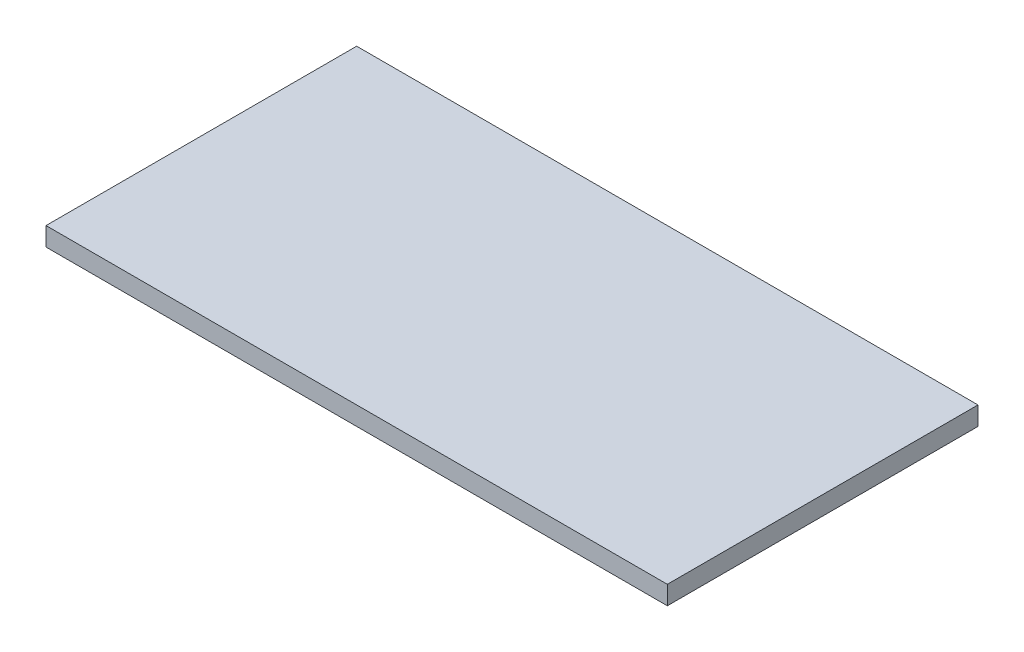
ISO-10303-21;
HEADER;
FILE_DESCRIPTION(('STEP AP214'),'2;1');
FILE_NAME('part.step','',(''),(''),'','','');
FILE_SCHEMA(('AUTOMOTIVE_DESIGN { 1 0 10303 214 1 1 1 1 }'));
ENDSEC;
DATA;
#1=APPLICATION_CONTEXT('core data for automotive mechanical design processes');
#2=APPLICATION_PROTOCOL_DEFINITION('international standard','automotive_design',2000,#1);
#3=PRODUCT_CONTEXT('',#1,'mechanical');
#4=PRODUCT('Part','Part','',(#3));
#5=PRODUCT_RELATED_PRODUCT_CATEGORY('part','',(#4));
#6=PRODUCT_DEFINITION_FORMATION('','',#4);
#7=PRODUCT_DEFINITION_CONTEXT('part definition',#1,'design');
#8=PRODUCT_DEFINITION('design','',#6,#7);
#9=PRODUCT_DEFINITION_SHAPE('','',#8);
#10=(LENGTH_UNIT() NAMED_UNIT(*) SI_UNIT(.MILLI.,.METRE.));
#11=(NAMED_UNIT(*) PLANE_ANGLE_UNIT() SI_UNIT($,.RADIAN.));
#12=(NAMED_UNIT(*) SI_UNIT($,.STERADIAN.) SOLID_ANGLE_UNIT());
#13=UNCERTAINTY_MEASURE_WITH_UNIT(LENGTH_MEASURE(1.E-05),#10,'distance_accuracy_value','');
#14=(GEOMETRIC_REPRESENTATION_CONTEXT(3) GLOBAL_UNCERTAINTY_ASSIGNED_CONTEXT((#13)) GLOBAL_UNIT_ASSIGNED_CONTEXT((#10,
#11,#12)) REPRESENTATION_CONTEXT('',''));
#15=CARTESIAN_POINT('',(0.,0.,0.));
#16=DIRECTION('',(0.,0.,1.));
#17=DIRECTION('',(1.,0.,0.));
#18=AXIS2_PLACEMENT_3D('',#15,#16,#17);
#19=CARTESIAN_POINT('',(-50.,3.,25.));
#20=DIRECTION('',(1.,0.,0.));
#21=DIRECTION('',(0.,0.,-1.));
#22=AXIS2_PLACEMENT_3D('',#19,#20,#21);
#23=PLANE('',#22);
#24=DIRECTION('',(0.,0.,1.));
#25=VECTOR('',#24,1.);
#26=CARTESIAN_POINT('',(-50.,0.,25.));
#27=LINE('',#26,#25);
#28=CARTESIAN_POINT('',(-50.,0.,-25.));
#29=VERTEX_POINT('',#28);
#30=CARTESIAN_POINT('',(-50.,0.,25.));
#31=VERTEX_POINT('',#30);
#32=EDGE_CURVE('E107',#29,#31,#27,.T.);
#33=ORIENTED_EDGE('',*,*,#32,.T.);
#34=DIRECTION('',(0.,-1.,0.));
#35=VECTOR('',#34,1.);
#36=CARTESIAN_POINT('',(-50.,3.,25.));
#37=LINE('',#36,#35);
#38=CARTESIAN_POINT('',(-50.,3.,25.));
#39=VERTEX_POINT('',#38);
#40=EDGE_CURVE('E11',#39,#31,#37,.T.);
#41=ORIENTED_EDGE('',*,*,#40,.F.);
#42=DIRECTION('',(0.,0.,1.));
#43=VECTOR('',#42,1.);
#44=CARTESIAN_POINT('',(-50.,3.,25.));
#45=LINE('',#44,#43);
#46=CARTESIAN_POINT('',(-50.,3.,-25.));
#47=VERTEX_POINT('',#46);
#48=EDGE_CURVE('E91',#47,#39,#45,.T.);
#49=ORIENTED_EDGE('',*,*,#48,.F.);
#50=DIRECTION('',(0.,-1.,0.));
#51=VECTOR('',#50,1.);
#52=CARTESIAN_POINT('',(-50.,3.,-25.));
#53=LINE('',#52,#51);
#54=EDGE_CURVE('E103',#47,#29,#53,.T.);
#55=ORIENTED_EDGE('',*,*,#54,.T.);
#56=EDGE_LOOP('',(#33,#41,#49,#55));
#57=FACE_BOUND('',#56,.T.);
#58=ADVANCED_FACE('F39',(#57),#23,.F.);
#59=CARTESIAN_POINT('',(50.,3.,25.));
#60=DIRECTION('',(0.,0.,-1.));
#61=DIRECTION('',(-1.,0.,0.));
#62=AXIS2_PLACEMENT_3D('',#59,#60,#61);
#63=PLANE('',#62);
#64=DIRECTION('',(1.,0.,0.));
#65=VECTOR('',#64,1.);
#66=CARTESIAN_POINT('',(50.,0.,25.));
#67=LINE('',#66,#65);
#68=CARTESIAN_POINT('',(50.,0.,25.));
#69=VERTEX_POINT('',#68);
#70=EDGE_CURVE('E96',#31,#69,#67,.T.);
#71=ORIENTED_EDGE('',*,*,#70,.T.);
#72=DIRECTION('',(0.,-1.,0.));
#73=VECTOR('',#72,1.);
#74=CARTESIAN_POINT('',(50.,3.,25.));
#75=LINE('',#74,#73);
#76=CARTESIAN_POINT('',(50.,3.,25.));
#77=VERTEX_POINT('',#76);
#78=EDGE_CURVE('E48',#77,#69,#75,.T.);
#79=ORIENTED_EDGE('',*,*,#78,.F.);
#80=DIRECTION('',(1.,0.,0.));
#81=VECTOR('',#80,1.);
#82=CARTESIAN_POINT('',(50.,3.,25.));
#83=LINE('',#82,#81);
#84=EDGE_CURVE('E86',#39,#77,#83,.T.);
#85=ORIENTED_EDGE('',*,*,#84,.F.);
#86=ORIENTED_EDGE('',*,*,#40,.T.);
#87=EDGE_LOOP('',(#71,#79,#85,#86));
#88=FACE_BOUND('',#87,.T.);
#89=ADVANCED_FACE('F95',(#88),#63,.F.);
#90=CARTESIAN_POINT('',(50.,3.,25.));
#91=DIRECTION('',(-1.,0.,0.));
#92=DIRECTION('',(0.,0.,1.));
#93=AXIS2_PLACEMENT_3D('',#90,#91,#92);
#94=PLANE('',#93);
#95=DIRECTION('',(0.,0.,-1.));
#96=VECTOR('',#95,1.);
#97=CARTESIAN_POINT('',(50.,0.,25.));
#98=LINE('',#97,#96);
#99=CARTESIAN_POINT('',(50.,0.,-25.));
#100=VERTEX_POINT('',#99);
#101=EDGE_CURVE('E73',#69,#100,#98,.T.);
#102=ORIENTED_EDGE('',*,*,#101,.T.);
#103=DIRECTION('',(0.,-1.,0.));
#104=VECTOR('',#103,1.);
#105=CARTESIAN_POINT('',(50.,3.,-25.));
#106=LINE('',#105,#104);
#107=CARTESIAN_POINT('',(50.,3.,-25.));
#108=VERTEX_POINT('',#107);
#109=EDGE_CURVE('E98',#108,#100,#106,.T.);
#110=ORIENTED_EDGE('',*,*,#109,.F.);
#111=DIRECTION('',(0.,0.,-1.));
#112=VECTOR('',#111,1.);
#113=CARTESIAN_POINT('',(50.,3.,25.));
#114=LINE('',#113,#112);
#115=EDGE_CURVE('E89',#77,#108,#114,.T.);
#116=ORIENTED_EDGE('',*,*,#115,.F.);
#117=ORIENTED_EDGE('',*,*,#78,.T.);
#118=EDGE_LOOP('',(#102,#110,#116,#117));
#119=FACE_BOUND('',#118,.T.);
#120=ADVANCED_FACE('F99',(#119),#94,.F.);
#121=CARTESIAN_POINT('',(50.,3.,-25.));
#122=DIRECTION('',(0.,0.,1.));
#123=DIRECTION('',(1.,0.,0.));
#124=AXIS2_PLACEMENT_3D('',#121,#122,#123);
#125=PLANE('',#124);
#126=DIRECTION('',(-1.,0.,0.));
#127=VECTOR('',#126,1.);
#128=CARTESIAN_POINT('',(50.,0.,-25.));
#129=LINE('',#128,#127);
#130=EDGE_CURVE('E79',#100,#29,#129,.T.);
#131=ORIENTED_EDGE('',*,*,#130,.T.);
#132=ORIENTED_EDGE('',*,*,#54,.F.);
#133=DIRECTION('',(-1.,0.,0.));
#134=VECTOR('',#133,1.);
#135=CARTESIAN_POINT('',(50.,3.,-25.));
#136=LINE('',#135,#134);
#137=EDGE_CURVE('E56',#108,#47,#136,.T.);
#138=ORIENTED_EDGE('',*,*,#137,.F.);
#139=ORIENTED_EDGE('',*,*,#109,.T.);
#140=EDGE_LOOP('',(#131,#132,#138,#139));
#141=FACE_BOUND('',#140,.T.);
#142=ADVANCED_FACE('F120',(#141),#125,.F.);
#143=CARTESIAN_POINT('',(0.,3.,0.));
#144=DIRECTION('',(0.,1.,0.));
#145=DIRECTION('',(0.,0.,1.));
#146=AXIS2_PLACEMENT_3D('',#143,#144,#145);
#147=PLANE('',#146);
#148=ORIENTED_EDGE('',*,*,#48,.T.);
#149=ORIENTED_EDGE('',*,*,#84,.T.);
#150=ORIENTED_EDGE('',*,*,#115,.T.);
#151=ORIENTED_EDGE('',*,*,#137,.T.);
#152=EDGE_LOOP('',(#148,#149,#150,#151));
#153=FACE_BOUND('',#152,.T.);
#154=ADVANCED_FACE('F87',(#153),#147,.T.);
#155=CARTESIAN_POINT('',(0.,0.,0.));
#156=DIRECTION('',(0.,1.,0.));
#157=DIRECTION('',(0.,0.,1.));
#158=AXIS2_PLACEMENT_3D('',#155,#156,#157);
#159=PLANE('',#158);
#160=ORIENTED_EDGE('',*,*,#32,.F.);
#161=ORIENTED_EDGE('',*,*,#130,.F.);
#162=ORIENTED_EDGE('',*,*,#101,.F.);
#163=ORIENTED_EDGE('',*,*,#70,.F.);
#164=EDGE_LOOP('',(#160,#161,#162,#163));
#165=FACE_BOUND('',#164,.T.);
#166=ADVANCED_FACE('F123',(#165),#159,.F.);
#167=CLOSED_SHELL('',(#58,#89,#120,#142,#154,#166));
#168=MANIFOLD_SOLID_BREP('B2',#167);
#169=ADVANCED_BREP_SHAPE_REPRESENTATION('',(#18,#168),#14);
#170=SHAPE_DEFINITION_REPRESENTATION(#9,#169);
ENDSEC;
END-ISO-10303-21;
